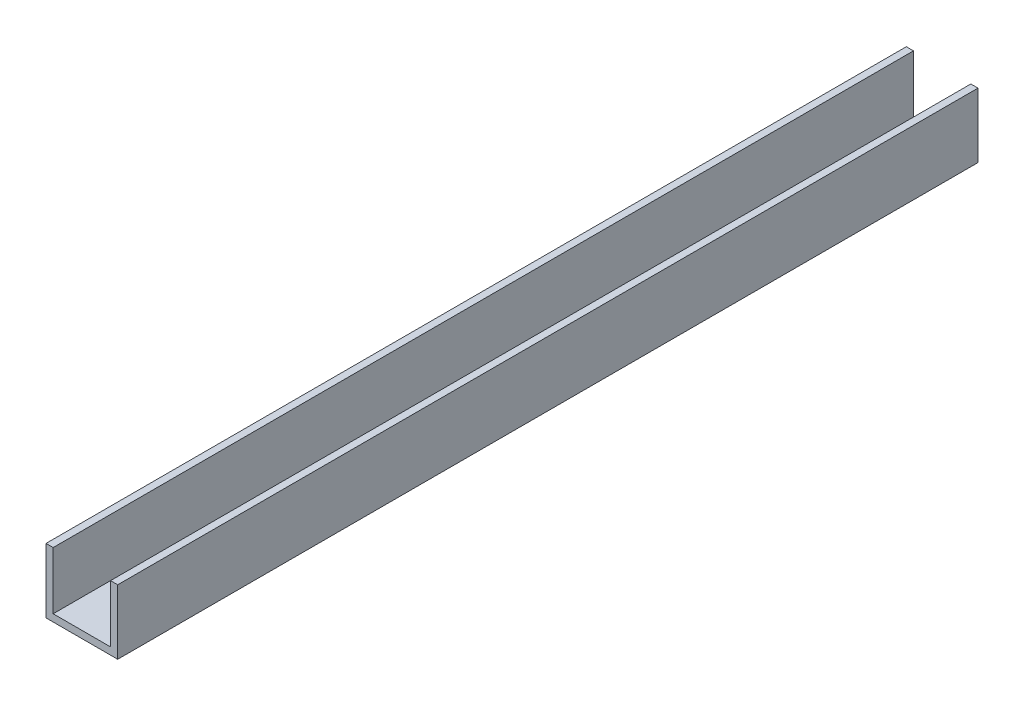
from build123d import *

# Parameters (mm, degrees)
BOSS_EXTRUDE2_DEPTH = 95.25
SKETCH4_R           = 1.5875
CUT_EXTRUDE1_DEPTH  = 97.420207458


with BuildPart() as part:
    # Sketch3 → Boss-Extrude2 (new, symmetric)
    with BuildSketch(Plane.XY):
        Polygon((-7.9375, 7.14375), (-7.9375, -7.14375), (7.9375, -7.14375), (7.9375, 7.14375), (6.35, 7.14375), (6.35, -5.55625), (-6.35, -5.55625), (-6.35, 7.14375), align=None)
    extrude(amount=BOSS_EXTRUDE2_DEPTH, both=True)

    # Sketch4 → Cut-Extrude1 (cut, through all)
    with BuildSketch(Plane(origin=(0, -5.55625, 0), x_dir=(1, 0, 0), z_dir=(0, 1, 0))):
        with Locations(Location((0, -79.375, 0), (0, 0, 180))):
            Circle(SKETCH4_R)
        with Locations(Location((0, 79.375, 0), (0, 0, 180))):
            Circle(SKETCH4_R)
    extrude(amount=-CUT_EXTRUDE1_DEPTH, mode=Mode.SUBTRACT)


solid = part.part
